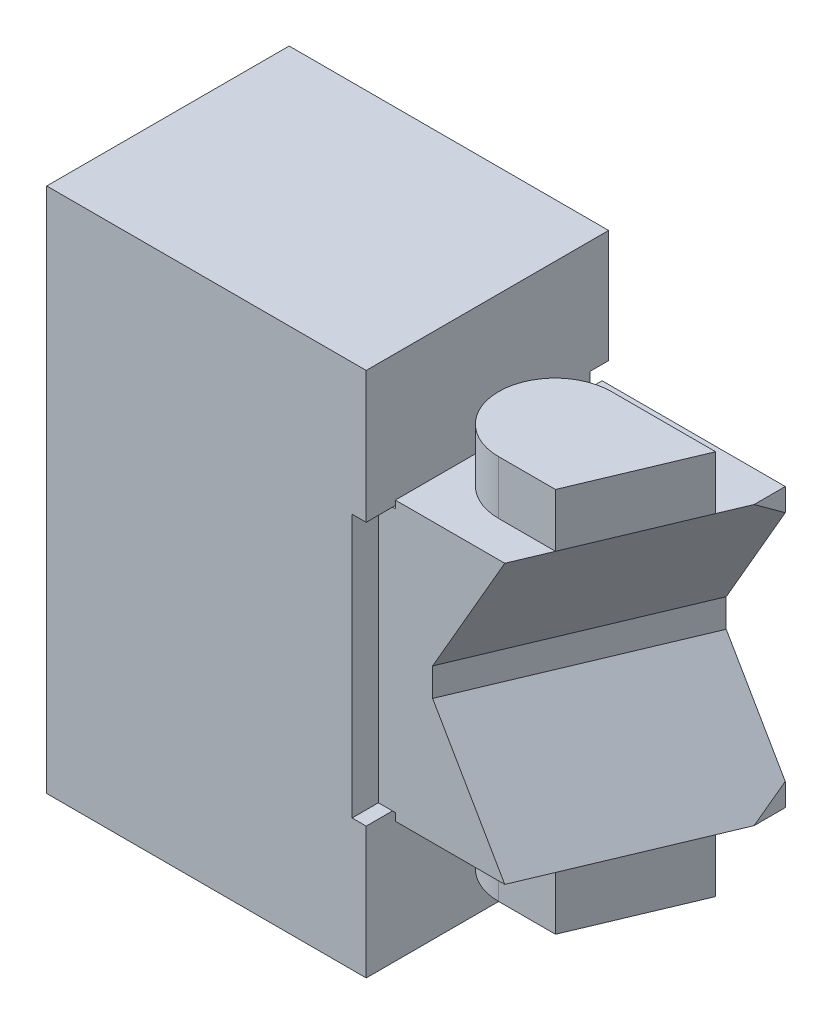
ISO-10303-21;
HEADER;
FILE_DESCRIPTION(('STEP AP214'),'2;1');
FILE_NAME('part.step','',(''),(''),'','','');
FILE_SCHEMA(('AUTOMOTIVE_DESIGN { 1 0 10303 214 1 1 1 1 }'));
ENDSEC;
DATA;
#1=APPLICATION_CONTEXT('core data for automotive mechanical design processes');
#2=APPLICATION_PROTOCOL_DEFINITION('international standard','automotive_design',2000,#1);
#3=PRODUCT_CONTEXT('',#1,'mechanical');
#4=PRODUCT('Part','Part','',(#3));
#5=PRODUCT_RELATED_PRODUCT_CATEGORY('part','',(#4));
#6=PRODUCT_DEFINITION_FORMATION('','',#4);
#7=PRODUCT_DEFINITION_CONTEXT('part definition',#1,'design');
#8=PRODUCT_DEFINITION('design','',#6,#7);
#9=PRODUCT_DEFINITION_SHAPE('','',#8);
#10=(LENGTH_UNIT() NAMED_UNIT(*) SI_UNIT(.MILLI.,.METRE.));
#11=(NAMED_UNIT(*) PLANE_ANGLE_UNIT() SI_UNIT($,.RADIAN.));
#12=(NAMED_UNIT(*) SI_UNIT($,.STERADIAN.) SOLID_ANGLE_UNIT());
#13=UNCERTAINTY_MEASURE_WITH_UNIT(LENGTH_MEASURE(1.E-05),#10,'distance_accuracy_value','');
#14=(GEOMETRIC_REPRESENTATION_CONTEXT(3) GLOBAL_UNCERTAINTY_ASSIGNED_CONTEXT((#13)) GLOBAL_UNIT_ASSIGNED_CONTEXT((#10,
#11,#12)) REPRESENTATION_CONTEXT('',''));
#15=CARTESIAN_POINT('',(0.,0.,0.));
#16=DIRECTION('',(0.,0.,1.));
#17=DIRECTION('',(1.,0.,0.));
#18=AXIS2_PLACEMENT_3D('',#15,#16,#17);
#19=CARTESIAN_POINT('',(0.,14.,12.9));
#20=DIRECTION('',(-1.,0.,0.));
#21=DIRECTION('',(0.,0.,1.));
#22=AXIS2_PLACEMENT_3D('',#19,#20,#21);
#23=PLANE('',#22);
#24=DIRECTION('',(0.,0.,1.));
#25=VECTOR('',#24,1.);
#26=CARTESIAN_POINT('',(0.,28.,12.9));
#27=LINE('',#26,#25);
#28=CARTESIAN_POINT('',(0.,28.,25.8));
#29=VERTEX_POINT('',#28);
#30=CARTESIAN_POINT('',(0.,28.,0.));
#31=VERTEX_POINT('',#30);
#32=EDGE_CURVE('E649',#29,#31,#27,.F.);
#33=ORIENTED_EDGE('',*,*,#32,.T.);
#34=DIRECTION('',(0.,1.,0.));
#35=VECTOR('',#34,1.);
#36=CARTESIAN_POINT('',(0.,14.,0.));
#37=LINE('',#36,#35);
#38=CARTESIAN_POINT('',(0.,16.,0.));
#39=VERTEX_POINT('',#38);
#40=EDGE_CURVE('E646',#31,#39,#37,.F.);
#41=ORIENTED_EDGE('',*,*,#40,.T.);
#42=DIRECTION('',(0.,0.,1.));
#43=VECTOR('',#42,1.);
#44=CARTESIAN_POINT('',(0.,16.,12.9));
#45=LINE('',#44,#43);
#46=CARTESIAN_POINT('',(0.,16.,2.));
#47=VERTEX_POINT('',#46);
#48=EDGE_CURVE('E661',#39,#47,#45,.T.);
#49=ORIENTED_EDGE('',*,*,#48,.T.);
#50=DIRECTION('',(0.,1.,0.));
#51=VECTOR('',#50,1.);
#52=CARTESIAN_POINT('',(0.,14.,2.));
#53=LINE('',#52,#51);
#54=CARTESIAN_POINT('',(0.,-16.,2.));
#55=VERTEX_POINT('',#54);
#56=EDGE_CURVE('E658',#47,#55,#53,.F.);
#57=ORIENTED_EDGE('',*,*,#56,.T.);
#58=DIRECTION('',(0.,0.,1.));
#59=VECTOR('',#58,1.);
#60=CARTESIAN_POINT('',(0.,-16.,12.9));
#61=LINE('',#60,#59);
#62=CARTESIAN_POINT('',(0.,-16.,0.));
#63=VERTEX_POINT('',#62);
#64=EDGE_CURVE('E655',#55,#63,#61,.F.);
#65=ORIENTED_EDGE('',*,*,#64,.T.);
#66=DIRECTION('',(0.,1.,0.));
#67=VECTOR('',#66,1.);
#68=CARTESIAN_POINT('',(0.,14.,0.));
#69=LINE('',#68,#67);
#70=CARTESIAN_POINT('',(0.,-28.,0.));
#71=VERTEX_POINT('',#70);
#72=EDGE_CURVE('E652',#63,#71,#69,.F.);
#73=ORIENTED_EDGE('',*,*,#72,.T.);
#74=DIRECTION('',(0.,0.,-1.));
#75=VECTOR('',#74,1.);
#76=CARTESIAN_POINT('',(0.,-28.,25.8));
#77=LINE('',#76,#75);
#78=CARTESIAN_POINT('',(0.,-28.,25.8));
#79=VERTEX_POINT('',#78);
#80=EDGE_CURVE('E640',#71,#79,#77,.F.);
#81=ORIENTED_EDGE('',*,*,#80,.T.);
#82=DIRECTION('',(0.,1.,0.));
#83=VECTOR('',#82,1.);
#84=CARTESIAN_POINT('',(0.,0.,25.8));
#85=LINE('',#84,#83);
#86=EDGE_CURVE('E611',#29,#79,#85,.F.);
#87=ORIENTED_EDGE('',*,*,#86,.F.);
#88=EDGE_LOOP('',(#33,#41,#49,#57,#65,#73,#81,#87));
#89=FACE_BOUND('',#88,.T.);
#90=ADVANCED_FACE('F14',(#89),#23,.T.);
#91=CARTESIAN_POINT('',(34.,14.,25.8));
#92=DIRECTION('',(0.,1.,0.));
#93=DIRECTION('',(0.,0.,-1.));
#94=AXIS2_PLACEMENT_3D('',#91,#92,#93);
#95=PLANE('',#94);
#96=DIRECTION('',(0.,0.,1.));
#97=VECTOR('',#96,1.);
#98=CARTESIAN_POINT('',(32.5,14.,13.9));
#99=LINE('',#98,#97);
#100=CARTESIAN_POINT('',(32.5,14.,25.8));
#101=VERTEX_POINT('',#100);
#102=CARTESIAN_POINT('',(32.5,14.,23.));
#103=VERTEX_POINT('',#102);
#104=EDGE_CURVE('E204',#101,#103,#99,.F.);
#105=ORIENTED_EDGE('',*,*,#104,.T.);
#106=DIRECTION('',(1.,0.,0.));
#107=VECTOR('',#106,1.);
#108=CARTESIAN_POINT('',(34.,14.,23.));
#109=LINE('',#108,#107);
#110=CARTESIAN_POINT('',(34.,14.,23.));
#111=VERTEX_POINT('',#110);
#112=EDGE_CURVE('E9',#103,#111,#109,.T.);
#113=ORIENTED_EDGE('',*,*,#112,.T.);
#114=DIRECTION('',(0.,0.,1.));
#115=VECTOR('',#114,1.);
#116=CARTESIAN_POINT('',(34.,14.,12.9));
#117=LINE('',#116,#115);
#118=CARTESIAN_POINT('',(34.,14.,25.8));
#119=VERTEX_POINT('',#118);
#120=EDGE_CURVE('E195',#111,#119,#117,.T.);
#121=ORIENTED_EDGE('',*,*,#120,.T.);
#122=DIRECTION('',(-1.,0.,0.));
#123=VECTOR('',#122,1.);
#124=CARTESIAN_POINT('',(34.,14.,25.8));
#125=LINE('',#124,#123);
#126=EDGE_CURVE('E252',#101,#119,#125,.F.);
#127=ORIENTED_EDGE('',*,*,#126,.F.);
#128=EDGE_LOOP('',(#105,#113,#121,#127));
#129=FACE_BOUND('',#128,.T.);
#130=ADVANCED_FACE('F200',(#129),#95,.F.);
#131=CARTESIAN_POINT('',(34.,28.,25.8));
#132=DIRECTION('',(0.,1.,0.));
#133=DIRECTION('',(0.,0.,-1.));
#134=AXIS2_PLACEMENT_3D('',#131,#132,#133);
#135=PLANE('',#134);
#136=ORIENTED_EDGE('',*,*,#32,.F.);
#137=DIRECTION('',(-1.,0.,0.));
#138=VECTOR('',#137,1.);
#139=CARTESIAN_POINT('',(34.,28.,25.8));
#140=LINE('',#139,#138);
#141=CARTESIAN_POINT('',(34.,28.,25.8));
#142=VERTEX_POINT('',#141);
#143=EDGE_CURVE('E617',#142,#29,#140,.T.);
#144=ORIENTED_EDGE('',*,*,#143,.F.);
#145=DIRECTION('',(0.,0.,-1.));
#146=VECTOR('',#145,1.);
#147=CARTESIAN_POINT('',(34.,28.,25.8));
#148=LINE('',#147,#146);
#149=CARTESIAN_POINT('',(34.,28.,0.));
#150=VERTEX_POINT('',#149);
#151=EDGE_CURVE('E194',#142,#150,#148,.T.);
#152=ORIENTED_EDGE('',*,*,#151,.T.);
#153=DIRECTION('',(-1.,0.,0.));
#154=VECTOR('',#153,1.);
#155=CARTESIAN_POINT('',(34.,28.,0.));
#156=LINE('',#155,#154);
#157=EDGE_CURVE('E663',#150,#31,#156,.T.);
#158=ORIENTED_EDGE('',*,*,#157,.T.);
#159=EDGE_LOOP('',(#136,#144,#152,#158));
#160=FACE_BOUND('',#159,.T.);
#161=ADVANCED_FACE('F554',(#160),#135,.T.);
#162=CARTESIAN_POINT('',(34.,28.,0.));
#163=DIRECTION('',(0.,0.,-1.));
#164=DIRECTION('',(0.,-1.,0.));
#165=AXIS2_PLACEMENT_3D('',#162,#163,#164);
#166=PLANE('',#165);
#167=ORIENTED_EDGE('',*,*,#157,.F.);
#168=DIRECTION('',(0.,1.,0.));
#169=VECTOR('',#168,1.);
#170=CARTESIAN_POINT('',(34.,14.,0.));
#171=LINE('',#170,#169);
#172=CARTESIAN_POINT('',(34.,16.,0.));
#173=VERTEX_POINT('',#172);
#174=EDGE_CURVE('E225',#150,#173,#171,.F.);
#175=ORIENTED_EDGE('',*,*,#174,.T.);
#176=DIRECTION('',(-1.,0.,0.));
#177=VECTOR('',#176,1.);
#178=CARTESIAN_POINT('',(34.,16.,0.));
#179=LINE('',#178,#177);
#180=EDGE_CURVE('E249',#173,#39,#179,.T.);
#181=ORIENTED_EDGE('',*,*,#180,.T.);
#182=ORIENTED_EDGE('',*,*,#40,.F.);
#183=EDGE_LOOP('',(#167,#175,#181,#182));
#184=FACE_BOUND('',#183,.T.);
#185=ADVANCED_FACE('F559',(#184),#166,.T.);
#186=CARTESIAN_POINT('',(34.,16.,2.));
#187=DIRECTION('',(0.,1.,0.));
#188=DIRECTION('',(0.,0.,-1.));
#189=AXIS2_PLACEMENT_3D('',#186,#187,#188);
#190=PLANE('',#189);
#191=DIRECTION('',(-1.,0.,0.));
#192=VECTOR('',#191,1.);
#193=CARTESIAN_POINT('',(34.,16.,2.));
#194=LINE('',#193,#192);
#195=CARTESIAN_POINT('',(34.,16.,2.));
#196=VERTEX_POINT('',#195);
#197=EDGE_CURVE('E245',#196,#47,#194,.T.);
#198=ORIENTED_EDGE('',*,*,#197,.T.);
#199=ORIENTED_EDGE('',*,*,#48,.F.);
#200=ORIENTED_EDGE('',*,*,#180,.F.);
#201=DIRECTION('',(0.,0.,1.));
#202=VECTOR('',#201,1.);
#203=CARTESIAN_POINT('',(34.,16.,12.9));
#204=LINE('',#203,#202);
#205=EDGE_CURVE('E218',#173,#196,#204,.T.);
#206=ORIENTED_EDGE('',*,*,#205,.T.);
#207=EDGE_LOOP('',(#198,#199,#200,#206));
#208=FACE_BOUND('',#207,.T.);
#209=ADVANCED_FACE('F555',(#208),#190,.F.);
#210=CARTESIAN_POINT('',(34.,-14.,2.));
#211=DIRECTION('',(0.,-1.,0.));
#212=DIRECTION('',(0.,0.,1.));
#213=AXIS2_PLACEMENT_3D('',#210,#211,#212);
#214=PLANE('',#213);
#215=DIRECTION('',(0.,0.,1.));
#216=VECTOR('',#215,1.);
#217=CARTESIAN_POINT('',(34.,-14.,12.9));
#218=LINE('',#217,#216);
#219=CARTESIAN_POINT('',(34.,-14.,25.8));
#220=VERTEX_POINT('',#219);
#221=CARTESIAN_POINT('',(34.,-14.,23.));
#222=VERTEX_POINT('',#221);
#223=EDGE_CURVE('E625',#220,#222,#218,.F.);
#224=ORIENTED_EDGE('',*,*,#223,.T.);
#225=DIRECTION('',(-1.,0.,0.));
#226=VECTOR('',#225,1.);
#227=CARTESIAN_POINT('',(34.,-14.,23.));
#228=LINE('',#227,#226);
#229=CARTESIAN_POINT('',(32.5,-14.,23.));
#230=VERTEX_POINT('',#229);
#231=EDGE_CURVE('E24',#222,#230,#228,.T.);
#232=ORIENTED_EDGE('',*,*,#231,.T.);
#233=DIRECTION('',(0.,0.,1.));
#234=VECTOR('',#233,1.);
#235=CARTESIAN_POINT('',(32.5,-14.,13.9));
#236=LINE('',#235,#234);
#237=CARTESIAN_POINT('',(32.5,-14.,25.8));
#238=VERTEX_POINT('',#237);
#239=EDGE_CURVE('E228',#230,#238,#236,.T.);
#240=ORIENTED_EDGE('',*,*,#239,.T.);
#241=DIRECTION('',(-1.,0.,0.));
#242=VECTOR('',#241,1.);
#243=CARTESIAN_POINT('',(34.,-14.,25.8));
#244=LINE('',#243,#242);
#245=EDGE_CURVE('E236',#220,#238,#244,.T.);
#246=ORIENTED_EDGE('',*,*,#245,.F.);
#247=EDGE_LOOP('',(#224,#232,#240,#246));
#248=FACE_BOUND('',#247,.T.);
#249=ADVANCED_FACE('F558',(#248),#214,.F.);
#250=CARTESIAN_POINT('',(34.,0.,2.));
#251=DIRECTION('',(0.,0.,1.));
#252=DIRECTION('',(0.,1.,0.));
#253=AXIS2_PLACEMENT_3D('',#250,#251,#252);
#254=PLANE('',#253);
#255=DIRECTION('',(0.,1.,0.));
#256=VECTOR('',#255,1.);
#257=CARTESIAN_POINT('',(34.,14.,2.));
#258=LINE('',#257,#256);
#259=CARTESIAN_POINT('',(34.,-14.,2.));
#260=VERTEX_POINT('',#259);
#261=CARTESIAN_POINT('',(34.,-16.,2.));
#262=VERTEX_POINT('',#261);
#263=EDGE_CURVE('E637',#260,#262,#258,.F.);
#264=ORIENTED_EDGE('',*,*,#263,.T.);
#265=DIRECTION('',(-1.,0.,0.));
#266=VECTOR('',#265,1.);
#267=CARTESIAN_POINT('',(34.,-16.,2.));
#268=LINE('',#267,#266);
#269=EDGE_CURVE('E242',#55,#262,#268,.F.);
#270=ORIENTED_EDGE('',*,*,#269,.F.);
#271=ORIENTED_EDGE('',*,*,#56,.F.);
#272=ORIENTED_EDGE('',*,*,#197,.F.);
#273=DIRECTION('',(0.,1.,0.));
#274=VECTOR('',#273,1.);
#275=CARTESIAN_POINT('',(34.,14.,2.));
#276=LINE('',#275,#274);
#277=CARTESIAN_POINT('',(34.,14.,2.));
#278=VERTEX_POINT('',#277);
#279=EDGE_CURVE('E217',#196,#278,#276,.F.);
#280=ORIENTED_EDGE('',*,*,#279,.T.);
#281=DIRECTION('',(-1.,0.,0.));
#282=VECTOR('',#281,1.);
#283=CARTESIAN_POINT('',(34.,14.,2.));
#284=LINE('',#283,#282);
#285=CARTESIAN_POINT('',(32.5,14.,2.));
#286=VERTEX_POINT('',#285);
#287=EDGE_CURVE('E189',#286,#278,#284,.F.);
#288=ORIENTED_EDGE('',*,*,#287,.F.);
#289=DIRECTION('',(0.,1.,0.));
#290=VECTOR('',#289,1.);
#291=CARTESIAN_POINT('',(32.5,0.,2.));
#292=LINE('',#291,#290);
#293=CARTESIAN_POINT('',(32.5,-14.,2.));
#294=VERTEX_POINT('',#293);
#295=EDGE_CURVE('E168',#286,#294,#292,.F.);
#296=ORIENTED_EDGE('',*,*,#295,.T.);
#297=DIRECTION('',(-1.,0.,0.));
#298=VECTOR('',#297,1.);
#299=CARTESIAN_POINT('',(34.,-14.,2.));
#300=LINE('',#299,#298);
#301=EDGE_CURVE('E233',#294,#260,#300,.F.);
#302=ORIENTED_EDGE('',*,*,#301,.T.);
#303=EDGE_LOOP('',(#264,#270,#271,#272,#280,#288,#296,#302));
#304=FACE_BOUND('',#303,.T.);
#305=ADVANCED_FACE('F564',(#304),#254,.F.);
#306=CARTESIAN_POINT('',(34.,-16.,2.));
#307=DIRECTION('',(0.,1.,0.));
#308=DIRECTION('',(0.,0.,-1.));
#309=AXIS2_PLACEMENT_3D('',#306,#307,#308);
#310=PLANE('',#309);
#311=ORIENTED_EDGE('',*,*,#64,.F.);
#312=ORIENTED_EDGE('',*,*,#269,.T.);
#313=DIRECTION('',(0.,0.,1.));
#314=VECTOR('',#313,1.);
#315=CARTESIAN_POINT('',(34.,-16.,12.9));
#316=LINE('',#315,#314);
#317=CARTESIAN_POINT('',(34.,-16.,0.));
#318=VERTEX_POINT('',#317);
#319=EDGE_CURVE('E634',#262,#318,#316,.F.);
#320=ORIENTED_EDGE('',*,*,#319,.T.);
#321=DIRECTION('',(-1.,0.,0.));
#322=VECTOR('',#321,1.);
#323=CARTESIAN_POINT('',(34.,-16.,0.));
#324=LINE('',#323,#322);
#325=EDGE_CURVE('E239',#318,#63,#324,.T.);
#326=ORIENTED_EDGE('',*,*,#325,.T.);
#327=EDGE_LOOP('',(#311,#312,#320,#326));
#328=FACE_BOUND('',#327,.T.);
#329=ADVANCED_FACE('F567',(#328),#310,.T.);
#330=CARTESIAN_POINT('',(34.,-28.,0.));
#331=DIRECTION('',(0.,0.,1.));
#332=DIRECTION('',(0.,1.,0.));
#333=AXIS2_PLACEMENT_3D('',#330,#331,#332);
#334=PLANE('',#333);
#335=DIRECTION('',(0.,1.,0.));
#336=VECTOR('',#335,1.);
#337=CARTESIAN_POINT('',(34.,14.,0.));
#338=LINE('',#337,#336);
#339=CARTESIAN_POINT('',(34.,-28.,0.));
#340=VERTEX_POINT('',#339);
#341=EDGE_CURVE('E631',#318,#340,#338,.F.);
#342=ORIENTED_EDGE('',*,*,#341,.T.);
#343=DIRECTION('',(-1.,0.,0.));
#344=VECTOR('',#343,1.);
#345=CARTESIAN_POINT('',(34.,-28.,0.));
#346=LINE('',#345,#344);
#347=EDGE_CURVE('E643',#340,#71,#346,.T.);
#348=ORIENTED_EDGE('',*,*,#347,.T.);
#349=ORIENTED_EDGE('',*,*,#72,.F.);
#350=ORIENTED_EDGE('',*,*,#325,.F.);
#351=EDGE_LOOP('',(#342,#348,#349,#350));
#352=FACE_BOUND('',#351,.T.);
#353=ADVANCED_FACE('F571',(#352),#334,.F.);
#354=CARTESIAN_POINT('',(34.,-28.,25.8));
#355=DIRECTION('',(0.,1.,0.));
#356=DIRECTION('',(0.,0.,-1.));
#357=AXIS2_PLACEMENT_3D('',#354,#355,#356);
#358=PLANE('',#357);
#359=DIRECTION('',(-1.,0.,0.));
#360=VECTOR('',#359,1.);
#361=CARTESIAN_POINT('',(34.,-28.,25.8));
#362=LINE('',#361,#360);
#363=CARTESIAN_POINT('',(34.,-28.,25.8));
#364=VERTEX_POINT('',#363);
#365=EDGE_CURVE('E605',#79,#364,#362,.F.);
#366=ORIENTED_EDGE('',*,*,#365,.F.);
#367=ORIENTED_EDGE('',*,*,#80,.F.);
#368=ORIENTED_EDGE('',*,*,#347,.F.);
#369=DIRECTION('',(0.,0.,1.));
#370=VECTOR('',#369,1.);
#371=CARTESIAN_POINT('',(34.,-28.,12.9));
#372=LINE('',#371,#370);
#373=EDGE_CURVE('E629',#340,#364,#372,.T.);
#374=ORIENTED_EDGE('',*,*,#373,.T.);
#375=EDGE_LOOP('',(#366,#367,#368,#374));
#376=FACE_BOUND('',#375,.T.);
#377=ADVANCED_FACE('F575',(#376),#358,.F.);
#378=CARTESIAN_POINT('',(34.,0.,25.8));
#379=DIRECTION('',(0.,0.,1.));
#380=DIRECTION('',(0.,1.,0.));
#381=AXIS2_PLACEMENT_3D('',#378,#379,#380);
#382=PLANE('',#381);
#383=ORIENTED_EDGE('',*,*,#365,.T.);
#384=DIRECTION('',(0.,1.,0.));
#385=VECTOR('',#384,1.);
#386=CARTESIAN_POINT('',(34.,0.,25.8));
#387=LINE('',#386,#385);
#388=EDGE_CURVE('E256',#364,#220,#387,.T.);
#389=ORIENTED_EDGE('',*,*,#388,.T.);
#390=ORIENTED_EDGE('',*,*,#245,.T.);
#391=DIRECTION('',(0.,1.,0.));
#392=VECTOR('',#391,1.);
#393=CARTESIAN_POINT('',(32.5,0.,25.8));
#394=LINE('',#393,#392);
#395=EDGE_CURVE('E622',#238,#101,#394,.T.);
#396=ORIENTED_EDGE('',*,*,#395,.T.);
#397=ORIENTED_EDGE('',*,*,#126,.T.);
#398=DIRECTION('',(0.,1.,0.));
#399=VECTOR('',#398,1.);
#400=CARTESIAN_POINT('',(34.,0.,25.8));
#401=LINE('',#400,#399);
#402=EDGE_CURVE('E216',#119,#142,#401,.T.);
#403=ORIENTED_EDGE('',*,*,#402,.T.);
#404=ORIENTED_EDGE('',*,*,#143,.T.);
#405=ORIENTED_EDGE('',*,*,#86,.T.);
#406=EDGE_LOOP('',(#383,#389,#390,#396,#397,#403,#404,#405));
#407=FACE_BOUND('',#406,.T.);
#408=ADVANCED_FACE('F591',(#407),#382,.T.);
#409=CARTESIAN_POINT('',(34.,14.,12.9));
#410=DIRECTION('',(-1.,0.,0.));
#411=DIRECTION('',(0.,0.,1.));
#412=AXIS2_PLACEMENT_3D('',#409,#410,#411);
#413=PLANE('',#412);
#414=ORIENTED_EDGE('',*,*,#388,.F.);
#415=ORIENTED_EDGE('',*,*,#373,.F.);
#416=ORIENTED_EDGE('',*,*,#341,.F.);
#417=ORIENTED_EDGE('',*,*,#319,.F.);
#418=ORIENTED_EDGE('',*,*,#263,.F.);
#419=EDGE_CURVE('E628',#222,#260,#218,.F.);
#420=ORIENTED_EDGE('',*,*,#419,.F.);
#421=ORIENTED_EDGE('',*,*,#223,.F.);
#422=EDGE_LOOP('',(#414,#415,#416,#417,#418,#420,#421));
#423=FACE_BOUND('',#422,.T.);
#424=ADVANCED_FACE('F582',(#423),#413,.F.);
#425=CARTESIAN_POINT('',(34.,14.,12.9));
#426=DIRECTION('',(-1.,0.,0.));
#427=DIRECTION('',(0.,0.,1.));
#428=AXIS2_PLACEMENT_3D('',#425,#426,#427);
#429=PLANE('',#428);
#430=ORIENTED_EDGE('',*,*,#279,.F.);
#431=ORIENTED_EDGE('',*,*,#205,.F.);
#432=ORIENTED_EDGE('',*,*,#174,.F.);
#433=ORIENTED_EDGE('',*,*,#151,.F.);
#434=ORIENTED_EDGE('',*,*,#402,.F.);
#435=ORIENTED_EDGE('',*,*,#120,.F.);
#436=EDGE_CURVE('E182',#278,#111,#117,.T.);
#437=ORIENTED_EDGE('',*,*,#436,.F.);
#438=EDGE_LOOP('',(#430,#431,#432,#433,#434,#435,#437));
#439=FACE_BOUND('',#438,.T.);
#440=ADVANCED_FACE('F213',(#439),#429,.F.);
#441=CARTESIAN_POINT('',(32.5,0.,13.9));
#442=DIRECTION('',(-1.,0.,0.));
#443=DIRECTION('',(0.,0.,1.));
#444=AXIS2_PLACEMENT_3D('',#441,#442,#443);
#445=PLANE('',#444);
#446=ORIENTED_EDGE('',*,*,#239,.F.);
#447=DIRECTION('',(0.,1.,0.));
#448=VECTOR('',#447,1.);
#449=CARTESIAN_POINT('',(32.5,0.,23.));
#450=LINE('',#449,#448);
#451=EDGE_CURVE('E33',#230,#103,#450,.T.);
#452=ORIENTED_EDGE('',*,*,#451,.T.);
#453=ORIENTED_EDGE('',*,*,#104,.F.);
#454=ORIENTED_EDGE('',*,*,#395,.F.);
#455=EDGE_LOOP('',(#446,#452,#453,#454));
#456=FACE_BOUND('',#455,.T.);
#457=ADVANCED_FACE('F495',(#456),#445,.F.);
#458=CARTESIAN_POINT('',(42.1545990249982,20.5,13.2));
#459=DIRECTION('',(0.,-1.,0.));
#460=DIRECTION('',(-1.,0.,0.));
#461=AXIS2_PLACEMENT_3D('',#458,#459,#460);
#462=PLANE('',#461);
#463=CARTESIAN_POINT('',(41.5,20.5,13.2));
#464=DIRECTION('',(0.,1.,0.));
#465=DIRECTION('',(1.,0.,0.));
#466=AXIS2_PLACEMENT_3D('',#463,#464,#465);
#467=CIRCLE('',#466,6.);
#468=CARTESIAN_POINT('',(41.5,20.5,7.2));
#469=VERTEX_POINT('',#468);
#470=CARTESIAN_POINT('',(41.5,20.5,19.2));
#471=VERTEX_POINT('',#470);
#472=EDGE_CURVE('E266',#469,#471,#467,.T.);
#473=ORIENTED_EDGE('',*,*,#472,.T.);
#474=DIRECTION('',(1.,0.,0.));
#475=VECTOR('',#474,1.);
#476=CARTESIAN_POINT('',(41.5,20.5,19.2));
#477=LINE('',#476,#475);
#478=CARTESIAN_POINT('',(47.5456686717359,20.5,19.2));
#479=VERTEX_POINT('',#478);
#480=EDGE_CURVE('E269',#471,#479,#477,.T.);
#481=ORIENTED_EDGE('',*,*,#480,.T.);
#482=DIRECTION('',(0.387449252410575,0.,-0.921891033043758));
#483=VECTOR('',#482,1.);
#484=CARTESIAN_POINT('',(52.5889881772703,20.5,7.2));
#485=LINE('',#484,#483);
#486=CARTESIAN_POINT('',(52.5889881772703,20.5,7.2));
#487=VERTEX_POINT('',#486);
#488=EDGE_CURVE('E272',#479,#487,#485,.T.);
#489=ORIENTED_EDGE('',*,*,#488,.T.);
#490=DIRECTION('',(-1.,0.,0.));
#491=VECTOR('',#490,1.);
#492=CARTESIAN_POINT('',(41.5,20.5,7.2));
#493=LINE('',#492,#491);
#494=EDGE_CURVE('E275',#487,#469,#493,.T.);
#495=ORIENTED_EDGE('',*,*,#494,.T.);
#496=EDGE_LOOP('',(#473,#481,#489,#495));
#497=FACE_BOUND('',#496,.T.);
#498=ADVANCED_FACE('F493',(#497),#462,.F.);
#499=CARTESIAN_POINT('',(42.1545990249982,-20.5,13.2));
#500=DIRECTION('',(0.,-1.,0.));
#501=DIRECTION('',(-1.,0.,0.));
#502=AXIS2_PLACEMENT_3D('',#499,#500,#501);
#503=PLANE('',#502);
#504=CARTESIAN_POINT('',(41.5,-20.5,13.2));
#505=DIRECTION('',(0.,-1.,0.));
#506=DIRECTION('',(-1.,0.,0.));
#507=AXIS2_PLACEMENT_3D('',#504,#505,#506);
#508=CIRCLE('',#507,6.);
#509=CARTESIAN_POINT('',(41.5,-20.5,19.2));
#510=VERTEX_POINT('',#509);
#511=CARTESIAN_POINT('',(41.5,-20.5,7.2));
#512=VERTEX_POINT('',#511);
#513=EDGE_CURVE('E286',#510,#512,#508,.T.);
#514=ORIENTED_EDGE('',*,*,#513,.T.);
#515=DIRECTION('',(1.,0.,0.));
#516=VECTOR('',#515,1.);
#517=CARTESIAN_POINT('',(41.5,-20.5,7.2));
#518=LINE('',#517,#516);
#519=CARTESIAN_POINT('',(52.5889881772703,-20.5,7.2));
#520=VERTEX_POINT('',#519);
#521=EDGE_CURVE('E300',#512,#520,#518,.T.);
#522=ORIENTED_EDGE('',*,*,#521,.T.);
#523=DIRECTION('',(-0.387449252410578,0.,0.921891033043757));
#524=VECTOR('',#523,1.);
#525=CARTESIAN_POINT('',(52.5889881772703,-20.5,7.2));
#526=LINE('',#525,#524);
#527=CARTESIAN_POINT('',(47.5456686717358,-20.5,19.2));
#528=VERTEX_POINT('',#527);
#529=EDGE_CURVE('E303',#520,#528,#526,.T.);
#530=ORIENTED_EDGE('',*,*,#529,.T.);
#531=DIRECTION('',(-1.,0.,0.));
#532=VECTOR('',#531,1.);
#533=CARTESIAN_POINT('',(41.5,-20.5,19.2));
#534=LINE('',#533,#532);
#535=EDGE_CURVE('E306',#528,#510,#534,.T.);
#536=ORIENTED_EDGE('',*,*,#535,.T.);
#537=EDGE_LOOP('',(#514,#522,#530,#536));
#538=FACE_BOUND('',#537,.T.);
#539=ADVANCED_FACE('F16',(#538),#503,.T.);
#540=CARTESIAN_POINT('',(41.5,-6.08141558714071,13.2));
#541=DIRECTION('',(0.,1.,0.));
#542=DIRECTION('',(1.,0.,0.));
#543=AXIS2_PLACEMENT_3D('',#540,#541,#542);
#544=CYLINDRICAL_SURFACE('',#543,6.);
#545=CARTESIAN_POINT('',(41.5,14.8,13.2));
#546=DIRECTION('',(0.,1.,0.));
#547=DIRECTION('',(1.,0.,0.));
#548=AXIS2_PLACEMENT_3D('',#545,#546,#547);
#549=CIRCLE('',#548,6.);
#550=CARTESIAN_POINT('',(41.5,14.8,19.2));
#551=VERTEX_POINT('',#550);
#552=CARTESIAN_POINT('',(41.5,14.8,7.2));
#553=VERTEX_POINT('',#552);
#554=EDGE_CURVE('E160',#551,#553,#549,.F.);
#555=ORIENTED_EDGE('',*,*,#554,.F.);
#556=DIRECTION('',(0.,1.,0.));
#557=VECTOR('',#556,1.);
#558=CARTESIAN_POINT('',(41.5,-6.08141558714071,19.2));
#559=LINE('',#558,#557);
#560=EDGE_CURVE('E278',#551,#471,#559,.T.);
#561=ORIENTED_EDGE('',*,*,#560,.T.);
#562=ORIENTED_EDGE('',*,*,#472,.F.);
#563=DIRECTION('',(0.,1.,0.));
#564=VECTOR('',#563,1.);
#565=CARTESIAN_POINT('',(41.5,-6.08141558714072,7.2));
#566=LINE('',#565,#564);
#567=EDGE_CURVE('E263',#553,#469,#566,.T.);
#568=ORIENTED_EDGE('',*,*,#567,.F.);
#569=EDGE_LOOP('',(#555,#561,#562,#568));
#570=FACE_BOUND('',#569,.T.);
#571=ADVANCED_FACE('F487',(#570),#544,.T.);
#572=CARTESIAN_POINT('',(41.5,-6.08141558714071,19.2));
#573=DIRECTION('',(0.,0.,1.));
#574=DIRECTION('',(0.,-1.,0.));
#575=AXIS2_PLACEMENT_3D('',#572,#573,#574);
#576=PLANE('',#575);
#577=DIRECTION('',(-1.,0.,0.));
#578=VECTOR('',#577,1.);
#579=CARTESIAN_POINT('',(41.5,14.8,19.2));
#580=LINE('',#579,#578);
#581=CARTESIAN_POINT('',(47.5456686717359,14.8,19.2));
#582=VERTEX_POINT('',#581);
#583=EDGE_CURVE('E157',#582,#551,#580,.T.);
#584=ORIENTED_EDGE('',*,*,#583,.F.);
#585=DIRECTION('',(0.,1.,0.));
#586=VECTOR('',#585,1.);
#587=CARTESIAN_POINT('',(47.5456686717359,-6.08141558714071,19.2));
#588=LINE('',#587,#586);
#589=EDGE_CURVE('E282',#582,#479,#588,.T.);
#590=ORIENTED_EDGE('',*,*,#589,.T.);
#591=ORIENTED_EDGE('',*,*,#480,.F.);
#592=ORIENTED_EDGE('',*,*,#560,.F.);
#593=EDGE_LOOP('',(#584,#590,#591,#592));
#594=FACE_BOUND('',#593,.T.);
#595=ADVANCED_FACE('F484',(#594),#576,.T.);
#596=CARTESIAN_POINT('',(41.5,-6.08141558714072,7.2));
#597=DIRECTION('',(0.,0.,-1.));
#598=DIRECTION('',(0.,1.,0.));
#599=AXIS2_PLACEMENT_3D('',#596,#597,#598);
#600=PLANE('',#599);
#601=DIRECTION('',(1.,0.,0.));
#602=VECTOR('',#601,1.);
#603=CARTESIAN_POINT('',(41.5,14.8,7.2));
#604=LINE('',#603,#602);
#605=CARTESIAN_POINT('',(52.5889881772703,14.8,7.2));
#606=VERTEX_POINT('',#605);
#607=EDGE_CURVE('E262',#553,#606,#604,.T.);
#608=ORIENTED_EDGE('',*,*,#607,.F.);
#609=ORIENTED_EDGE('',*,*,#567,.T.);
#610=ORIENTED_EDGE('',*,*,#494,.F.);
#611=DIRECTION('',(0.,1.,0.));
#612=VECTOR('',#611,1.);
#613=CARTESIAN_POINT('',(52.5889881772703,-6.08141558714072,7.2));
#614=LINE('',#613,#612);
#615=EDGE_CURVE('E280',#606,#487,#614,.T.);
#616=ORIENTED_EDGE('',*,*,#615,.F.);
#617=EDGE_LOOP('',(#608,#609,#610,#616));
#618=FACE_BOUND('',#617,.T.);
#619=ADVANCED_FACE('F491',(#618),#600,.T.);
#620=CARTESIAN_POINT('',(52.5889881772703,-6.08141558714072,7.2));
#621=DIRECTION('',(0.921891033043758,0.,0.387449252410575));
#622=DIRECTION('',(-0.387449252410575,0.,0.921891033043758));
#623=AXIS2_PLACEMENT_3D('',#620,#621,#622);
#624=PLANE('',#623);
#625=DIRECTION('',(-0.387449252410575,0.,0.921891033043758));
#626=VECTOR('',#625,1.);
#627=CARTESIAN_POINT('',(52.5889881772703,14.8,7.2));
#628=LINE('',#627,#626);
#629=EDGE_CURVE('E259',#606,#582,#628,.T.);
#630=ORIENTED_EDGE('',*,*,#629,.F.);
#631=ORIENTED_EDGE('',*,*,#615,.T.);
#632=ORIENTED_EDGE('',*,*,#488,.F.);
#633=ORIENTED_EDGE('',*,*,#589,.F.);
#634=EDGE_LOOP('',(#630,#631,#632,#633));
#635=FACE_BOUND('',#634,.T.);
#636=ADVANCED_FACE('F480',(#635),#624,.T.);
#637=CARTESIAN_POINT('',(52.5889881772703,6.08141558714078,7.2));
#638=DIRECTION('',(0.921891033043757,0.,0.387449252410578));
#639=DIRECTION('',(-0.387449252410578,0.,0.921891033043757));
#640=AXIS2_PLACEMENT_3D('',#637,#638,#639);
#641=PLANE('',#640);
#642=DIRECTION('',(0.387449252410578,0.,-0.921891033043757));
#643=VECTOR('',#642,1.);
#644=CARTESIAN_POINT('',(52.5889881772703,-14.8,7.2));
#645=LINE('',#644,#643);
#646=CARTESIAN_POINT('',(47.5456686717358,-14.8,19.2));
#647=VERTEX_POINT('',#646);
#648=CARTESIAN_POINT('',(52.5889881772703,-14.8,7.2));
#649=VERTEX_POINT('',#648);
#650=EDGE_CURVE('E287',#647,#649,#645,.T.);
#651=ORIENTED_EDGE('',*,*,#650,.F.);
#652=DIRECTION('',(0.,-1.,0.));
#653=VECTOR('',#652,1.);
#654=CARTESIAN_POINT('',(47.5456686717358,6.08141558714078,19.2));
#655=LINE('',#654,#653);
#656=EDGE_CURVE('E311',#647,#528,#655,.T.);
#657=ORIENTED_EDGE('',*,*,#656,.T.);
#658=ORIENTED_EDGE('',*,*,#529,.F.);
#659=DIRECTION('',(0.,-1.,0.));
#660=VECTOR('',#659,1.);
#661=CARTESIAN_POINT('',(52.5889881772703,6.08141558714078,7.2));
#662=LINE('',#661,#660);
#663=EDGE_CURVE('E313',#649,#520,#662,.T.);
#664=ORIENTED_EDGE('',*,*,#663,.F.);
#665=EDGE_LOOP('',(#651,#657,#658,#664));
#666=FACE_BOUND('',#665,.T.);
#667=ADVANCED_FACE('F419',(#666),#641,.T.);
#668=CARTESIAN_POINT('',(41.5,6.08141558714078,13.2));
#669=DIRECTION('',(0.,-1.,0.));
#670=DIRECTION('',(-1.,0.,0.));
#671=AXIS2_PLACEMENT_3D('',#668,#669,#670);
#672=CYLINDRICAL_SURFACE('',#671,6.);
#673=CARTESIAN_POINT('',(41.5,-14.8,13.2));
#674=DIRECTION('',(0.,-1.,0.));
#675=DIRECTION('',(-1.,0.,0.));
#676=AXIS2_PLACEMENT_3D('',#673,#674,#675);
#677=CIRCLE('',#676,6.);
#678=CARTESIAN_POINT('',(41.5,-14.8,7.2));
#679=VERTEX_POINT('',#678);
#680=CARTESIAN_POINT('',(41.5,-14.8,19.2));
#681=VERTEX_POINT('',#680);
#682=EDGE_CURVE('E294',#679,#681,#677,.F.);
#683=ORIENTED_EDGE('',*,*,#682,.F.);
#684=DIRECTION('',(0.,-1.,0.));
#685=VECTOR('',#684,1.);
#686=CARTESIAN_POINT('',(41.5,6.08141558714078,7.2));
#687=LINE('',#686,#685);
#688=EDGE_CURVE('E309',#679,#512,#687,.T.);
#689=ORIENTED_EDGE('',*,*,#688,.T.);
#690=ORIENTED_EDGE('',*,*,#513,.F.);
#691=DIRECTION('',(0.,-1.,0.));
#692=VECTOR('',#691,1.);
#693=CARTESIAN_POINT('',(41.5,6.08141558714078,19.2));
#694=LINE('',#693,#692);
#695=EDGE_CURVE('E291',#681,#510,#694,.T.);
#696=ORIENTED_EDGE('',*,*,#695,.F.);
#697=EDGE_LOOP('',(#683,#689,#690,#696));
#698=FACE_BOUND('',#697,.T.);
#699=ADVANCED_FACE('F426',(#698),#672,.T.);
#700=CARTESIAN_POINT('',(41.5,6.08141558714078,7.2));
#701=DIRECTION('',(0.,0.,-1.));
#702=DIRECTION('',(0.,1.,0.));
#703=AXIS2_PLACEMENT_3D('',#700,#701,#702);
#704=PLANE('',#703);
#705=DIRECTION('',(-1.,0.,0.));
#706=VECTOR('',#705,1.);
#707=CARTESIAN_POINT('',(41.5,-14.8,7.2));
#708=LINE('',#707,#706);
#709=EDGE_CURVE('E297',#649,#679,#708,.T.);
#710=ORIENTED_EDGE('',*,*,#709,.F.);
#711=ORIENTED_EDGE('',*,*,#663,.T.);
#712=ORIENTED_EDGE('',*,*,#521,.F.);
#713=ORIENTED_EDGE('',*,*,#688,.F.);
#714=EDGE_LOOP('',(#710,#711,#712,#713));
#715=FACE_BOUND('',#714,.T.);
#716=ADVANCED_FACE('F415',(#715),#704,.T.);
#717=CARTESIAN_POINT('',(41.5,6.08141558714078,19.2));
#718=DIRECTION('',(0.,0.,1.));
#719=DIRECTION('',(-1.,0.,0.));
#720=AXIS2_PLACEMENT_3D('',#717,#718,#719);
#721=PLANE('',#720);
#722=DIRECTION('',(1.,0.,0.));
#723=VECTOR('',#722,1.);
#724=CARTESIAN_POINT('',(41.5,-14.8,19.2));
#725=LINE('',#724,#723);
#726=EDGE_CURVE('E290',#681,#647,#725,.T.);
#727=ORIENTED_EDGE('',*,*,#726,.F.);
#728=ORIENTED_EDGE('',*,*,#695,.T.);
#729=ORIENTED_EDGE('',*,*,#535,.F.);
#730=ORIENTED_EDGE('',*,*,#656,.F.);
#731=EDGE_LOOP('',(#727,#728,#729,#730));
#732=FACE_BOUND('',#731,.T.);
#733=ADVANCED_FACE('F428',(#732),#721,.T.);
#734=CARTESIAN_POINT('',(53.8,0.,11.9));
#735=DIRECTION('',(1.,0.,0.));
#736=DIRECTION('',(0.,-1.,0.));
#737=AXIS2_PLACEMENT_3D('',#734,#735,#736);
#738=PLANE('',#737);
#739=DIRECTION('',(0.,0.588524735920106,-0.808479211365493));
#740=VECTOR('',#739,1.);
#741=CARTESIAN_POINT('',(53.8,-14.8,4.3185363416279));
#742=LINE('',#741,#740);
#743=CARTESIAN_POINT('',(53.8,-14.8,4.3185363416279));
#744=VERTEX_POINT('',#743);
#745=CARTESIAN_POINT('',(53.8,-12.3843031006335,1.));
#746=VERTEX_POINT('',#745);
#747=EDGE_CURVE('E396',#744,#746,#742,.T.);
#748=ORIENTED_EDGE('',*,*,#747,.F.);
#749=DIRECTION('',(0.,0.,-1.));
#750=VECTOR('',#749,1.);
#751=CARTESIAN_POINT('',(53.8,-14.8,0.8));
#752=LINE('',#751,#750);
#753=CARTESIAN_POINT('',(53.8,-14.8,1.));
#754=VERTEX_POINT('',#753);
#755=EDGE_CURVE('E401',#754,#744,#752,.F.);
#756=ORIENTED_EDGE('',*,*,#755,.F.);
#757=DIRECTION('',(0.,-1.,0.));
#758=VECTOR('',#757,1.);
#759=CARTESIAN_POINT('',(53.8,0.,1.));
#760=LINE('',#759,#758);
#761=EDGE_CURVE('E360',#746,#754,#760,.T.);
#762=ORIENTED_EDGE('',*,*,#761,.F.);
#763=EDGE_LOOP('',(#748,#756,#762));
#764=FACE_BOUND('',#763,.T.);
#765=ADVANCED_FACE('F506',(#764),#738,.T.);
#766=CARTESIAN_POINT('',(53.8,0.,11.9));
#767=DIRECTION('',(1.,0.,0.));
#768=DIRECTION('',(0.,-1.,0.));
#769=AXIS2_PLACEMENT_3D('',#766,#767,#768);
#770=PLANE('',#769);
#771=DIRECTION('',(0.,0.,-1.));
#772=VECTOR('',#771,1.);
#773=CARTESIAN_POINT('',(53.8,14.8,23.));
#774=LINE('',#773,#772);
#775=CARTESIAN_POINT('',(53.8,14.8,4.3185363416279));
#776=VERTEX_POINT('',#775);
#777=CARTESIAN_POINT('',(53.8,14.8,1.));
#778=VERTEX_POINT('',#777);
#779=EDGE_CURVE('E381',#776,#778,#774,.T.);
#780=ORIENTED_EDGE('',*,*,#779,.F.);
#781=DIRECTION('',(0.,0.588524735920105,0.808479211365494));
#782=VECTOR('',#781,1.);
#783=CARTESIAN_POINT('',(53.8,12.3843031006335,1.));
#784=LINE('',#783,#782);
#785=CARTESIAN_POINT('',(53.8,12.3843031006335,1.));
#786=VERTEX_POINT('',#785);
#787=EDGE_CURVE('E391',#786,#776,#784,.T.);
#788=ORIENTED_EDGE('',*,*,#787,.F.);
#789=DIRECTION('',(0.,-1.,0.));
#790=VECTOR('',#789,1.);
#791=CARTESIAN_POINT('',(53.8,0.,1.));
#792=LINE('',#791,#790);
#793=EDGE_CURVE('E371',#778,#786,#792,.T.);
#794=ORIENTED_EDGE('',*,*,#793,.F.);
#795=EDGE_LOOP('',(#780,#788,#794));
#796=FACE_BOUND('',#795,.T.);
#797=ADVANCED_FACE('F466',(#796),#770,.T.);
#798=CARTESIAN_POINT('',(34.5,14.8,23.));
#799=DIRECTION('',(0.,1.,0.));
#800=DIRECTION('',(1.,0.,0.));
#801=AXIS2_PLACEMENT_3D('',#798,#799,#800);
#802=PLANE('',#801);
#803=ORIENTED_EDGE('',*,*,#607,.T.);
#804=DIRECTION('',(0.387449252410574,0.,-0.921891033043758));
#805=VECTOR('',#804,1.);
#806=CARTESIAN_POINT('',(45.9486174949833,14.8,23.));
#807=LINE('',#806,#805);
#808=EDGE_CURVE('E385',#606,#776,#807,.T.);
#809=ORIENTED_EDGE('',*,*,#808,.T.);
#810=ORIENTED_EDGE('',*,*,#779,.T.);
#811=DIRECTION('',(1.,0.,0.));
#812=VECTOR('',#811,1.);
#813=CARTESIAN_POINT('',(43.5228679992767,14.8,1.));
#814=LINE('',#813,#812);
#815=CARTESIAN_POINT('',(34.3,14.8,1.));
#816=VERTEX_POINT('',#815);
#817=EDGE_CURVE('E373',#816,#778,#814,.T.);
#818=ORIENTED_EDGE('',*,*,#817,.F.);
#819=DIRECTION('',(0.,0.,-1.));
#820=VECTOR('',#819,1.);
#821=CARTESIAN_POINT('',(34.3,14.8,23.));
#822=LINE('',#821,#820);
#823=CARTESIAN_POINT('',(34.3,14.8,23.));
#824=VERTEX_POINT('',#823);
#825=EDGE_CURVE('E386',#816,#824,#822,.F.);
#826=ORIENTED_EDGE('',*,*,#825,.T.);
#827=DIRECTION('',(-1.,0.,0.));
#828=VECTOR('',#827,1.);
#829=CARTESIAN_POINT('',(34.5,14.8,23.));
#830=LINE('',#829,#828);
#831=CARTESIAN_POINT('',(45.9486174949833,14.8,23.));
#832=VERTEX_POINT('',#831);
#833=EDGE_CURVE('E210',#832,#824,#830,.T.);
#834=ORIENTED_EDGE('',*,*,#833,.F.);
#835=EDGE_CURVE('E383',#832,#582,#807,.T.);
#836=ORIENTED_EDGE('',*,*,#835,.T.);
#837=ORIENTED_EDGE('',*,*,#583,.T.);
#838=ORIENTED_EDGE('',*,*,#554,.T.);
#839=EDGE_LOOP('',(#803,#809,#810,#818,#826,#834,#836,#837,#838));
#840=FACE_BOUND('',#839,.T.);
#841=ADVANCED_FACE('F461',(#840),#802,.T.);
#842=CARTESIAN_POINT('',(38.9346435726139,-5.42869839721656,11.9));
#843=DIRECTION('',(0.813797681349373,-0.469846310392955,0.342020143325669));
#844=DIRECTION('',(-0.5,-0.866025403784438,0.));
#845=AXIS2_PLACEMENT_3D('',#842,#843,#844);
#846=PLANE('',#845);
#847=DIRECTION('',(0.5,0.866025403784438,0.));
#848=VECTOR('',#847,1.);
#849=CARTESIAN_POINT('',(38.267979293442,1.49674440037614,23.));
#850=LINE('',#849,#848);
#851=CARTESIAN_POINT('',(38.267979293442,1.49674440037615,23.));
#852=VERTEX_POINT('',#851);
#853=EDGE_CURVE('E340',#852,#832,#850,.T.);
#854=ORIENTED_EDGE('',*,*,#853,.F.);
#855=DIRECTION('',(0.387515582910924,0.000135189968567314,-0.921863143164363));
#856=VECTOR('',#855,1.);
#857=CARTESIAN_POINT('',(38.267979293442,1.49674440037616,23.));
#858=LINE('',#857,#856);
#859=CARTESIAN_POINT('',(47.5159277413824,1.49997067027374,1.));
#860=VERTEX_POINT('',#859);
#861=EDGE_CURVE('E389',#852,#860,#858,.T.);
#862=ORIENTED_EDGE('',*,*,#861,.T.);
#863=DIRECTION('',(-0.5,-0.866025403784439,0.));
#864=VECTOR('',#863,1.);
#865=CARTESIAN_POINT('',(53.8,12.3843031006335,1.));
#866=LINE('',#865,#864);
#867=EDGE_CURVE('E368',#786,#860,#866,.T.);
#868=ORIENTED_EDGE('',*,*,#867,.F.);
#869=ORIENTED_EDGE('',*,*,#787,.T.);
#870=ORIENTED_EDGE('',*,*,#808,.F.);
#871=ORIENTED_EDGE('',*,*,#629,.T.);
#872=ORIENTED_EDGE('',*,*,#835,.F.);
#873=EDGE_LOOP('',(#854,#862,#868,#869,#870,#871,#872));
#874=FACE_BOUND('',#873,.T.);
#875=ADVANCED_FACE('F474',(#874),#846,.T.);
#876=CARTESIAN_POINT('',(42.933989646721,-8.15,11.9));
#877=DIRECTION('',(0.921863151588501,0.,0.387515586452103));
#878=DIRECTION('',(-0.387515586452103,0.,0.921863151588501));
#879=AXIS2_PLACEMENT_3D('',#876,#877,#878);
#880=PLANE('',#879);
#881=DIRECTION('',(0.,-1.,0.));
#882=VECTOR('',#881,1.);
#883=CARTESIAN_POINT('',(38.267979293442,-14.8,23.));
#884=LINE('',#883,#882);
#885=CARTESIAN_POINT('',(38.267979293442,-1.49674440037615,23.));
#886=VERTEX_POINT('',#885);
#887=EDGE_CURVE('E342',#886,#852,#884,.F.);
#888=ORIENTED_EDGE('',*,*,#887,.F.);
#889=DIRECTION('',(0.387515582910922,-0.000135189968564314,-0.921863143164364));
#890=VECTOR('',#889,1.);
#891=CARTESIAN_POINT('',(38.267979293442,-1.49674440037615,23.));
#892=LINE('',#891,#890);
#893=CARTESIAN_POINT('',(47.5159277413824,-1.49997067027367,1.));
#894=VERTEX_POINT('',#893);
#895=EDGE_CURVE('E394',#886,#894,#892,.T.);
#896=ORIENTED_EDGE('',*,*,#895,.T.);
#897=DIRECTION('',(0.,-1.,0.));
#898=VECTOR('',#897,1.);
#899=CARTESIAN_POINT('',(47.5159277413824,0.,1.));
#900=LINE('',#899,#898);
#901=EDGE_CURVE('E365',#860,#894,#900,.T.);
#902=ORIENTED_EDGE('',*,*,#901,.F.);
#903=ORIENTED_EDGE('',*,*,#861,.F.);
#904=EDGE_LOOP('',(#888,#896,#902,#903));
#905=FACE_BOUND('',#904,.T.);
#906=ADVANCED_FACE('F471',(#905),#880,.T.);
#907=CARTESIAN_POINT('',(48.4432315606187,-11.0406591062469,11.9));
#908=DIRECTION('',(0.813797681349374,0.469846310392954,0.342020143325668));
#909=DIRECTION('',(0.5,-0.866025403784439,0.));
#910=AXIS2_PLACEMENT_3D('',#907,#908,#909);
#911=PLANE('',#910);
#912=DIRECTION('',(0.387449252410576,0.,-0.921891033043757));
#913=VECTOR('',#912,1.);
#914=CARTESIAN_POINT('',(45.9486174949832,-14.8,23.));
#915=LINE('',#914,#913);
#916=CARTESIAN_POINT('',(45.9486174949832,-14.8,23.));
#917=VERTEX_POINT('',#916);
#918=EDGE_CURVE('E398',#917,#647,#915,.T.);
#919=ORIENTED_EDGE('',*,*,#918,.T.);
#920=ORIENTED_EDGE('',*,*,#650,.T.);
#921=EDGE_CURVE('E400',#649,#744,#915,.T.);
#922=ORIENTED_EDGE('',*,*,#921,.T.);
#923=ORIENTED_EDGE('',*,*,#747,.T.);
#924=DIRECTION('',(0.5,-0.866025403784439,0.));
#925=VECTOR('',#924,1.);
#926=CARTESIAN_POINT('',(47.5159277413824,-1.49997067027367,1.));
#927=LINE('',#926,#925);
#928=EDGE_CURVE('E362',#894,#746,#927,.T.);
#929=ORIENTED_EDGE('',*,*,#928,.F.);
#930=ORIENTED_EDGE('',*,*,#895,.F.);
#931=DIRECTION('',(-0.5,0.866025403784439,0.));
#932=VECTOR('',#931,1.);
#933=CARTESIAN_POINT('',(45.9486174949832,-14.8,23.));
#934=LINE('',#933,#932);
#935=EDGE_CURVE('E344',#917,#886,#934,.T.);
#936=ORIENTED_EDGE('',*,*,#935,.F.);
#937=EDGE_LOOP('',(#919,#920,#922,#923,#929,#930,#936));
#938=FACE_BOUND('',#937,.T.);
#939=ADVANCED_FACE('F409',(#938),#911,.T.);
#940=CARTESIAN_POINT('',(34.5,-14.8,0.8));
#941=DIRECTION('',(0.,-1.,0.));
#942=DIRECTION('',(-1.,0.,0.));
#943=AXIS2_PLACEMENT_3D('',#940,#941,#942);
#944=PLANE('',#943);
#945=ORIENTED_EDGE('',*,*,#726,.T.);
#946=ORIENTED_EDGE('',*,*,#918,.F.);
#947=DIRECTION('',(-1.,0.,0.));
#948=VECTOR('',#947,1.);
#949=CARTESIAN_POINT('',(34.5,-14.8,23.));
#950=LINE('',#949,#948);
#951=CARTESIAN_POINT('',(34.3,-14.8,23.));
#952=VERTEX_POINT('',#951);
#953=EDGE_CURVE('E346',#952,#917,#950,.F.);
#954=ORIENTED_EDGE('',*,*,#953,.F.);
#955=DIRECTION('',(0.,0.,-1.));
#956=VECTOR('',#955,1.);
#957=CARTESIAN_POINT('',(34.3,-14.8,12.));
#958=LINE('',#957,#956);
#959=CARTESIAN_POINT('',(34.3,-14.8,1.));
#960=VERTEX_POINT('',#959);
#961=EDGE_CURVE('E378',#952,#960,#958,.T.);
#962=ORIENTED_EDGE('',*,*,#961,.T.);
#963=DIRECTION('',(1.,0.,0.));
#964=VECTOR('',#963,1.);
#965=CARTESIAN_POINT('',(43.5228679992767,-14.8,1.));
#966=LINE('',#965,#964);
#967=EDGE_CURVE('E358',#754,#960,#966,.F.);
#968=ORIENTED_EDGE('',*,*,#967,.F.);
#969=ORIENTED_EDGE('',*,*,#755,.T.);
#970=ORIENTED_EDGE('',*,*,#921,.F.);
#971=ORIENTED_EDGE('',*,*,#709,.T.);
#972=ORIENTED_EDGE('',*,*,#682,.T.);
#973=EDGE_LOOP('',(#945,#946,#954,#962,#968,#969,#970,#971,#972));
#974=FACE_BOUND('',#973,.T.);
#975=ADVANCED_FACE('F411',(#974),#944,.T.);
#976=CARTESIAN_POINT('',(34.3,14.4,12.));
#977=DIRECTION('',(1.,0.,0.));
#978=DIRECTION('',(0.,0.,1.));
#979=AXIS2_PLACEMENT_3D('',#976,#977,#978);
#980=PLANE('',#979);
#981=DIRECTION('',(0.,0.,-1.));
#982=VECTOR('',#981,1.);
#983=CARTESIAN_POINT('',(34.3,14.,1.));
#984=LINE('',#983,#982);
#985=CARTESIAN_POINT('',(34.3,14.,1.));
#986=VERTEX_POINT('',#985);
#987=CARTESIAN_POINT('',(34.3,14.,23.));
#988=VERTEX_POINT('',#987);
#989=EDGE_CURVE('E351',#986,#988,#984,.F.);
#990=ORIENTED_EDGE('',*,*,#989,.T.);
#991=DIRECTION('',(0.,-1.,0.));
#992=VECTOR('',#991,1.);
#993=CARTESIAN_POINT('',(34.3,14.4,23.));
#994=LINE('',#993,#992);
#995=EDGE_CURVE('E18',#824,#988,#994,.T.);
#996=ORIENTED_EDGE('',*,*,#995,.F.);
#997=ORIENTED_EDGE('',*,*,#825,.F.);
#998=DIRECTION('',(0.,-1.,0.));
#999=VECTOR('',#998,1.);
#1000=CARTESIAN_POINT('',(34.3,0.,1.));
#1001=LINE('',#1000,#999);
#1002=EDGE_CURVE('E376',#986,#816,#1001,.F.);
#1003=ORIENTED_EDGE('',*,*,#1002,.F.);
#1004=EDGE_LOOP('',(#990,#996,#997,#1003));
#1005=FACE_BOUND('',#1004,.T.);
#1006=ADVANCED_FACE('F459',(#1005),#980,.F.);
#1007=CARTESIAN_POINT('',(34.5,-14.8,23.));
#1008=DIRECTION('',(0.,0.,1.));
#1009=DIRECTION('',(-1.,0.,0.));
#1010=AXIS2_PLACEMENT_3D('',#1007,#1008,#1009);
#1011=PLANE('',#1010);
#1012=ORIENTED_EDGE('',*,*,#451,.F.);
#1013=ORIENTED_EDGE('',*,*,#231,.F.);
#1014=DIRECTION('',(1.,0.,0.));
#1015=VECTOR('',#1014,1.);
#1016=CARTESIAN_POINT('',(32.5,-14.,23.));
#1017=LINE('',#1016,#1015);
#1018=CARTESIAN_POINT('',(34.3,-14.,23.));
#1019=VERTEX_POINT('',#1018);
#1020=EDGE_CURVE('E209',#222,#1019,#1017,.T.);
#1021=ORIENTED_EDGE('',*,*,#1020,.T.);
#1022=DIRECTION('',(0.,-1.,0.));
#1023=VECTOR('',#1022,1.);
#1024=CARTESIAN_POINT('',(34.3,-14.8,23.));
#1025=LINE('',#1024,#1023);
#1026=EDGE_CURVE('E348',#1019,#952,#1025,.T.);
#1027=ORIENTED_EDGE('',*,*,#1026,.T.);
#1028=ORIENTED_EDGE('',*,*,#953,.T.);
#1029=ORIENTED_EDGE('',*,*,#935,.T.);
#1030=ORIENTED_EDGE('',*,*,#887,.T.);
#1031=ORIENTED_EDGE('',*,*,#853,.T.);
#1032=ORIENTED_EDGE('',*,*,#833,.T.);
#1033=ORIENTED_EDGE('',*,*,#995,.T.);
#1034=DIRECTION('',(-1.,0.,0.));
#1035=VECTOR('',#1034,1.);
#1036=CARTESIAN_POINT('',(34.5,14.,23.));
#1037=LINE('',#1036,#1035);
#1038=EDGE_CURVE('E187',#988,#111,#1037,.T.);
#1039=ORIENTED_EDGE('',*,*,#1038,.T.);
#1040=ORIENTED_EDGE('',*,*,#112,.F.);
#1041=EDGE_LOOP('',(#1012,#1013,#1021,#1027,#1028,#1029,#1030,#1031,#1032,#1033,#1039,#1040));
#1042=FACE_BOUND('',#1041,.T.);
#1043=ADVANCED_FACE('F206',(#1042),#1011,.T.);
#1044=CARTESIAN_POINT('',(34.3,-14.4,12.));
#1045=DIRECTION('',(1.,0.,0.));
#1046=DIRECTION('',(0.,-1.,0.));
#1047=AXIS2_PLACEMENT_3D('',#1044,#1045,#1046);
#1048=PLANE('',#1047);
#1049=DIRECTION('',(0.,0.,-1.));
#1050=VECTOR('',#1049,1.);
#1051=CARTESIAN_POINT('',(34.3,-14.,23.));
#1052=LINE('',#1051,#1050);
#1053=CARTESIAN_POINT('',(34.3,-14.,1.));
#1054=VERTEX_POINT('',#1053);
#1055=EDGE_CURVE('E335',#1019,#1054,#1052,.T.);
#1056=ORIENTED_EDGE('',*,*,#1055,.T.);
#1057=DIRECTION('',(0.,-1.,0.));
#1058=VECTOR('',#1057,1.);
#1059=CARTESIAN_POINT('',(34.3,0.,1.));
#1060=LINE('',#1059,#1058);
#1061=EDGE_CURVE('E356',#960,#1054,#1060,.F.);
#1062=ORIENTED_EDGE('',*,*,#1061,.F.);
#1063=ORIENTED_EDGE('',*,*,#961,.F.);
#1064=ORIENTED_EDGE('',*,*,#1026,.F.);
#1065=EDGE_LOOP('',(#1056,#1062,#1063,#1064));
#1066=FACE_BOUND('',#1065,.T.);
#1067=ADVANCED_FACE('F438',(#1066),#1048,.F.);
#1068=CARTESIAN_POINT('',(43.5228679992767,0.,1.));
#1069=DIRECTION('',(0.,0.,-1.));
#1070=DIRECTION('',(1.,0.,0.));
#1071=AXIS2_PLACEMENT_3D('',#1068,#1069,#1070);
#1072=PLANE('',#1071);
#1073=ORIENTED_EDGE('',*,*,#1061,.T.);
#1074=DIRECTION('',(1.,0.,0.));
#1075=VECTOR('',#1074,1.);
#1076=CARTESIAN_POINT('',(32.5,-14.,1.));
#1077=LINE('',#1076,#1075);
#1078=CARTESIAN_POINT('',(33.,-14.,1.));
#1079=VERTEX_POINT('',#1078);
#1080=EDGE_CURVE('E332',#1054,#1079,#1077,.F.);
#1081=ORIENTED_EDGE('',*,*,#1080,.T.);
#1082=DIRECTION('',(0.,-1.,0.));
#1083=VECTOR('',#1082,1.);
#1084=CARTESIAN_POINT('',(33.,0.,1.));
#1085=LINE('',#1084,#1083);
#1086=CARTESIAN_POINT('',(33.,14.,1.));
#1087=VERTEX_POINT('',#1086);
#1088=EDGE_CURVE('E327',#1087,#1079,#1085,.T.);
#1089=ORIENTED_EDGE('',*,*,#1088,.F.);
#1090=DIRECTION('',(-1.,0.,0.));
#1091=VECTOR('',#1090,1.);
#1092=CARTESIAN_POINT('',(32.5,14.,1.));
#1093=LINE('',#1092,#1091);
#1094=EDGE_CURVE('E353',#1087,#986,#1093,.F.);
#1095=ORIENTED_EDGE('',*,*,#1094,.T.);
#1096=ORIENTED_EDGE('',*,*,#1002,.T.);
#1097=ORIENTED_EDGE('',*,*,#817,.T.);
#1098=ORIENTED_EDGE('',*,*,#793,.T.);
#1099=ORIENTED_EDGE('',*,*,#867,.T.);
#1100=ORIENTED_EDGE('',*,*,#901,.T.);
#1101=ORIENTED_EDGE('',*,*,#928,.T.);
#1102=ORIENTED_EDGE('',*,*,#761,.T.);
#1103=ORIENTED_EDGE('',*,*,#967,.T.);
#1104=EDGE_LOOP('',(#1073,#1081,#1089,#1095,#1096,#1097,#1098,#1099,#1100,#1101,#1102,#1103));
#1105=FACE_BOUND('',#1104,.T.);
#1106=ADVANCED_FACE('F442',(#1105),#1072,.T.);
#1107=CARTESIAN_POINT('',(32.75,0.,1.25));
#1108=DIRECTION('',(-0.707106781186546,0.,-0.707106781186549));
#1109=DIRECTION('',(0.707106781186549,0.,-0.707106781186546));
#1110=AXIS2_PLACEMENT_3D('',#1107,#1108,#1109);
#1111=PLANE('',#1110);
#1112=DIRECTION('',(0.707106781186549,0.,-0.707106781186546));
#1113=VECTOR('',#1112,1.);
#1114=CARTESIAN_POINT('',(32.75,-14.,1.25));
#1115=LINE('',#1114,#1113);
#1116=CARTESIAN_POINT('',(32.5,-14.,1.5));
#1117=VERTEX_POINT('',#1116);
#1118=EDGE_CURVE('E324',#1079,#1117,#1115,.F.);
#1119=ORIENTED_EDGE('',*,*,#1118,.T.);
#1120=DIRECTION('',(0.,-1.,0.));
#1121=VECTOR('',#1120,1.);
#1122=CARTESIAN_POINT('',(32.5,0.,1.5));
#1123=LINE('',#1122,#1121);
#1124=CARTESIAN_POINT('',(32.5,14.,1.5));
#1125=VERTEX_POINT('',#1124);
#1126=EDGE_CURVE('E254',#1117,#1125,#1123,.F.);
#1127=ORIENTED_EDGE('',*,*,#1126,.T.);
#1128=DIRECTION('',(0.707106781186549,0.,-0.707106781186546));
#1129=VECTOR('',#1128,1.);
#1130=CARTESIAN_POINT('',(32.75,14.,1.25));
#1131=LINE('',#1130,#1129);
#1132=EDGE_CURVE('E329',#1125,#1087,#1131,.T.);
#1133=ORIENTED_EDGE('',*,*,#1132,.T.);
#1134=ORIENTED_EDGE('',*,*,#1088,.T.);
#1135=EDGE_LOOP('',(#1119,#1127,#1133,#1134));
#1136=FACE_BOUND('',#1135,.T.);
#1137=ADVANCED_FACE('F452',(#1136),#1111,.T.);
#1138=CARTESIAN_POINT('',(32.5,0.,12.));
#1139=DIRECTION('',(1.,0.,0.));
#1140=DIRECTION('',(0.,-1.,0.));
#1141=AXIS2_PLACEMENT_3D('',#1138,#1139,#1140);
#1142=PLANE('',#1141);
#1143=DIRECTION('',(0.,0.,-1.));
#1144=VECTOR('',#1143,1.);
#1145=CARTESIAN_POINT('',(32.5,-14.,12.));
#1146=LINE('',#1145,#1144);
#1147=EDGE_CURVE('E320',#294,#1117,#1146,.T.);
#1148=ORIENTED_EDGE('',*,*,#1147,.F.);
#1149=ORIENTED_EDGE('',*,*,#295,.F.);
#1150=DIRECTION('',(0.,0.,-1.));
#1151=VECTOR('',#1150,1.);
#1152=CARTESIAN_POINT('',(32.5,14.,12.));
#1153=LINE('',#1152,#1151);
#1154=EDGE_CURVE('E322',#1125,#286,#1153,.F.);
#1155=ORIENTED_EDGE('',*,*,#1154,.F.);
#1156=ORIENTED_EDGE('',*,*,#1126,.F.);
#1157=EDGE_LOOP('',(#1148,#1149,#1155,#1156));
#1158=FACE_BOUND('',#1157,.T.);
#1159=ADVANCED_FACE('F453',(#1158),#1142,.F.);
#1160=CARTESIAN_POINT('',(32.5,-14.,23.));
#1161=DIRECTION('',(0.,1.,0.));
#1162=DIRECTION('',(1.,0.,0.));
#1163=AXIS2_PLACEMENT_3D('',#1160,#1161,#1162);
#1164=PLANE('',#1163);
#1165=ORIENTED_EDGE('',*,*,#419,.T.);
#1166=ORIENTED_EDGE('',*,*,#301,.F.);
#1167=ORIENTED_EDGE('',*,*,#1147,.T.);
#1168=ORIENTED_EDGE('',*,*,#1118,.F.);
#1169=ORIENTED_EDGE('',*,*,#1080,.F.);
#1170=ORIENTED_EDGE('',*,*,#1055,.F.);
#1171=ORIENTED_EDGE('',*,*,#1020,.F.);
#1172=EDGE_LOOP('',(#1165,#1166,#1167,#1168,#1169,#1170,#1171));
#1173=FACE_BOUND('',#1172,.T.);
#1174=ADVANCED_FACE('F447',(#1173),#1164,.F.);
#1175=CARTESIAN_POINT('',(32.5,14.,1.));
#1176=DIRECTION('',(0.,-1.,0.));
#1177=DIRECTION('',(-1.,0.,0.));
#1178=AXIS2_PLACEMENT_3D('',#1175,#1176,#1177);
#1179=PLANE('',#1178);
#1180=ORIENTED_EDGE('',*,*,#1154,.T.);
#1181=ORIENTED_EDGE('',*,*,#287,.T.);
#1182=ORIENTED_EDGE('',*,*,#436,.T.);
#1183=ORIENTED_EDGE('',*,*,#1038,.F.);
#1184=ORIENTED_EDGE('',*,*,#989,.F.);
#1185=ORIENTED_EDGE('',*,*,#1094,.F.);
#1186=ORIENTED_EDGE('',*,*,#1132,.F.);
#1187=EDGE_LOOP('',(#1180,#1181,#1182,#1183,#1184,#1185,#1186));
#1188=FACE_BOUND('',#1187,.T.);
#1189=ADVANCED_FACE('F184',(#1188),#1179,.F.);
#1190=CLOSED_SHELL('',(#90,#130,#161,#185,#209,#249,#305,#329,#353,#377,#408,#424,#440,#457,
#498,#539,#571,#595,#619,#636,#667,#699,#716,#733,#765,#797,#841,#875,#906,#939,#975,#1006,
#1043,#1067,#1106,#1137,#1159,#1174,#1189));
#1191=MANIFOLD_SOLID_BREP('B1',#1190);
#1192=ADVANCED_BREP_SHAPE_REPRESENTATION('',(#18,#1191),#14);
#1193=SHAPE_DEFINITION_REPRESENTATION(#9,#1192);
ENDSEC;
END-ISO-10303-21;
